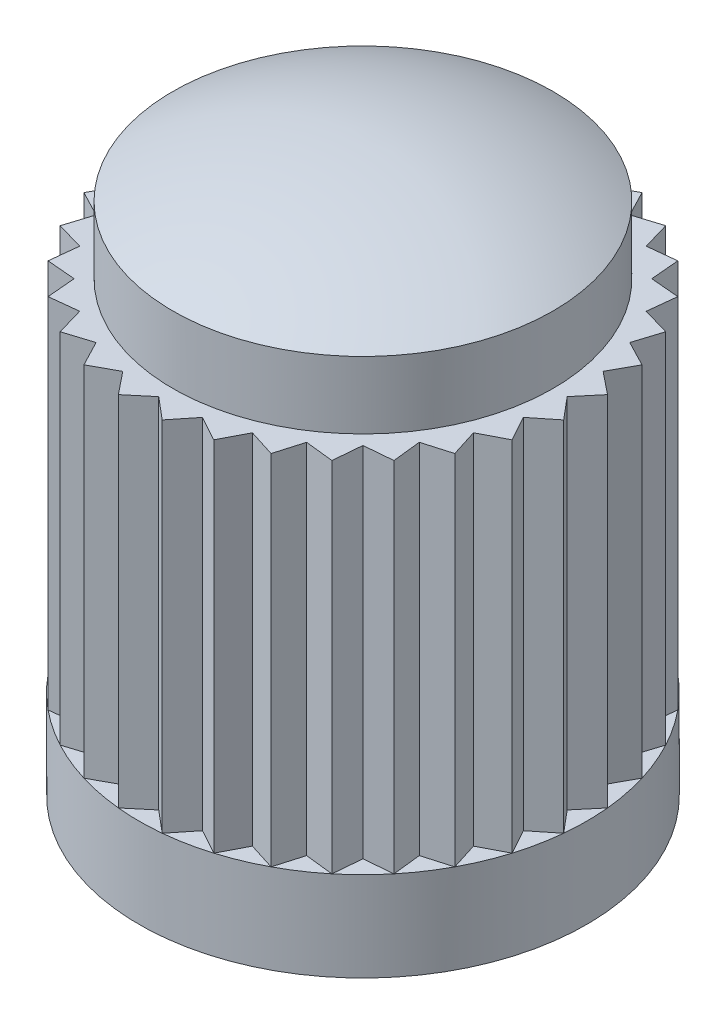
from build123d import *

# Parameters (mm, degrees)
ENL_V_MAT_EXTRU_2_DEPTH      = 8
R_P_TITION_CIRCULAIRE1_COUNT = 32


with BuildPart() as part:
    # Esquisse1 → R_volution1 (revolve)
    with BuildSketch(Plane.XY, mode=Mode.PRIVATE) as r_volution1_sk:
        with BuildLine():
            Line((-5, 0), (-5, 10))
            Line((-5, 10), (-4.25, 10))
            Line((-4.25, 10), (-4.25, 11.5))
            ThreePointArc((-4.25, 11.5), (-2.195022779, 12.320542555), (0, 12.6))
            Line((0, 12.6), (0, 10.31653118))
            ThreePointArc((0, 10.31653118), (-1.01244654, 10.236908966), (-2, 10))
            Line((-2, 10), (-3.5, 10))
            Line((-3.5, 10), (-3.5, 5))
            Line((-3.5, 5), (-4, 5))
            Line((-4, 5), (-4, 0))
            Line((-4, 0), (-5, 0))
        make_face()
    revolve(r_volution1_sk.sketch.rotate(Axis((0, 0, 0), (0, 1, 0)), 270), axis=Axis((0, 0, 0), (0, 1, 0)))

    # Esquisse2 → Enl_v. mat.-Extru.2 (cut)
    with BuildSketch(Plane(origin=(0, 10, 0), x_dir=(-1, 0, 0), z_dir=(0, 1, 0))):
        with BuildLine():
            Line((-4.975923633, -0.490085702), (-4.56418565, 0))
            Line((-4.56418565, 0), (-4.975923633, 0.490085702))
            ThreePointArc((-4.975923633, 0.490085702), (-5.152071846, 0), (-4.975923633, -0.490085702))
        make_face()
    enl_v_mat_extru_2 = extrude(amount=-ENL_V_MAT_EXTRU_2_DEPTH, mode=Mode.SUBTRACT)

    # R_p_tition circulaire1: Enl_v. mat.-Extru.2 ×32 about axis
    r_p_tition_circulaire1_axis = Axis((0, 0, 0), (0, 1, 0))
    for i in range(1, R_P_TITION_CIRCULAIRE1_COUNT):
        add(enl_v_mat_extru_2.rotate(r_p_tition_circulaire1_axis, i * 360 / R_P_TITION_CIRCULAIRE1_COUNT), mode=Mode.SUBTRACT)


solid = part.part
